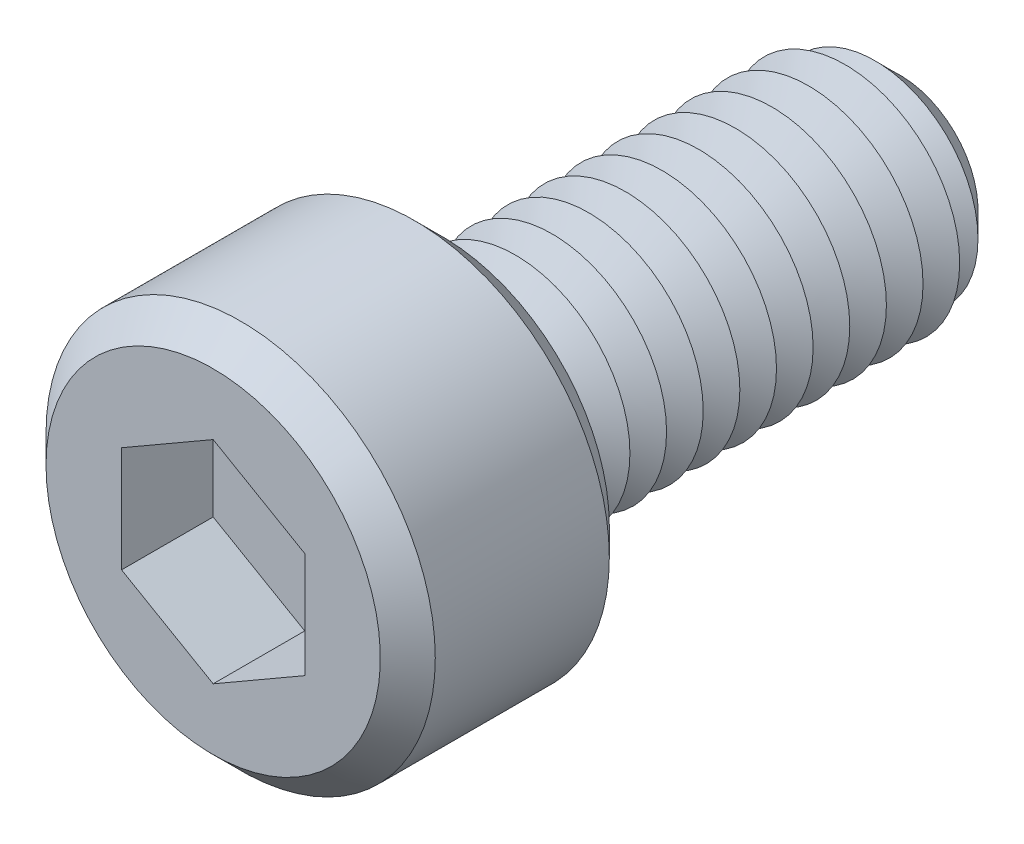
ISO-10303-21;
HEADER;
FILE_DESCRIPTION(('STEP AP214'),'2;1');
FILE_NAME('part.step','',(''),(''),'','','');
FILE_SCHEMA(('AUTOMOTIVE_DESIGN { 1 0 10303 214 1 1 1 1 }'));
ENDSEC;
DATA;
#1=APPLICATION_CONTEXT('core data for automotive mechanical design processes');
#2=APPLICATION_PROTOCOL_DEFINITION('international standard','automotive_design',2000,#1);
#3=PRODUCT_CONTEXT('',#1,'mechanical');
#4=PRODUCT('Part','Part','',(#3));
#5=PRODUCT_RELATED_PRODUCT_CATEGORY('part','',(#4));
#6=PRODUCT_DEFINITION_FORMATION('','',#4);
#7=PRODUCT_DEFINITION_CONTEXT('part definition',#1,'design');
#8=PRODUCT_DEFINITION('design','',#6,#7);
#9=PRODUCT_DEFINITION_SHAPE('','',#8);
#10=(LENGTH_UNIT() NAMED_UNIT(*) SI_UNIT(.MILLI.,.METRE.));
#11=(NAMED_UNIT(*) PLANE_ANGLE_UNIT() SI_UNIT($,.RADIAN.));
#12=(NAMED_UNIT(*) SI_UNIT($,.STERADIAN.) SOLID_ANGLE_UNIT());
#13=UNCERTAINTY_MEASURE_WITH_UNIT(LENGTH_MEASURE(1.E-05),#10,'distance_accuracy_value','');
#14=(GEOMETRIC_REPRESENTATION_CONTEXT(3) GLOBAL_UNCERTAINTY_ASSIGNED_CONTEXT((#13)) GLOBAL_UNIT_ASSIGNED_CONTEXT((#10,
#11,#12)) REPRESENTATION_CONTEXT('',''));
#15=CARTESIAN_POINT('',(0.,0.,0.));
#16=DIRECTION('',(0.,0.,1.));
#17=DIRECTION('',(1.,0.,0.));
#18=AXIS2_PLACEMENT_3D('',#15,#16,#17);
#19=CARTESIAN_POINT('',(0.,0.,5.));
#20=DIRECTION('',(0.,0.,-1.));
#21=DIRECTION('',(-1.,0.,0.));
#22=AXIS2_PLACEMENT_3D('',#19,#20,#21);
#23=CYLINDRICAL_SURFACE('',#22,4.25);
#24=CARTESIAN_POINT('',(0.,0.,0.600000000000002));
#25=DIRECTION('',(0.,0.,1.));
#26=DIRECTION('',(1.,0.,0.));
#27=AXIS2_PLACEMENT_3D('',#24,#25,#26);
#28=CIRCLE('',#27,4.25);
#29=CARTESIAN_POINT('',(4.25,0.,0.600000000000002));
#30=VERTEX_POINT('',#29);
#31=EDGE_CURVE('E272',#30,#30,#28,.T.);
#32=ORIENTED_EDGE('',*,*,#31,.T.);
#33=EDGE_LOOP('',(#32));
#34=FACE_BOUND('',#33,.T.);
#35=CARTESIAN_POINT('',(0.,0.,4.39999999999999));
#36=DIRECTION('',(0.,0.,1.));
#37=DIRECTION('',(1.,0.,0.));
#38=AXIS2_PLACEMENT_3D('',#35,#36,#37);
#39=CIRCLE('',#38,4.25);
#40=CARTESIAN_POINT('',(-4.25,0.,4.39999999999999));
#41=VERTEX_POINT('',#40);
#42=EDGE_CURVE('E266',#41,#41,#39,.F.);
#43=ORIENTED_EDGE('',*,*,#42,.T.);
#44=EDGE_LOOP('',(#43));
#45=FACE_BOUND('',#44,.T.);
#46=ADVANCED_FACE('F39',(#34,#45),#23,.T.);
#47=CARTESIAN_POINT('',(0.,0.,5.));
#48=DIRECTION('',(0.,0.,1.));
#49=DIRECTION('',(1.,0.,0.));
#50=AXIS2_PLACEMENT_3D('',#47,#48,#49);
#51=PLANE('',#50);
#52=CARTESIAN_POINT('',(0.,0.,5.));
#53=DIRECTION('',(0.,0.,1.));
#54=DIRECTION('',(1.,0.,0.));
#55=AXIS2_PLACEMENT_3D('',#52,#53,#54);
#56=CIRCLE('',#55,3.65);
#57=CARTESIAN_POINT('',(-3.65,0.,5.));
#58=VERTEX_POINT('',#57);
#59=EDGE_CURVE('E11',#58,#58,#56,.T.);
#60=ORIENTED_EDGE('',*,*,#59,.T.);
#61=EDGE_LOOP('',(#60));
#62=FACE_BOUND('',#61,.T.);
#63=DIRECTION('',(-0.866025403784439,0.5,0.));
#64=VECTOR('',#63,1.);
#65=CARTESIAN_POINT('',(2.,1.15470053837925,5.));
#66=LINE('',#65,#64);
#67=CARTESIAN_POINT('',(2.,1.15470053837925,5.));
#68=VERTEX_POINT('',#67);
#69=CARTESIAN_POINT('',(0.,2.3094010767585,5.));
#70=VERTEX_POINT('',#69);
#71=EDGE_CURVE('E55',#68,#70,#66,.T.);
#72=ORIENTED_EDGE('',*,*,#71,.F.);
#73=DIRECTION('',(0.,1.,0.));
#74=VECTOR('',#73,1.);
#75=CARTESIAN_POINT('',(2.,-1.15470053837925,5.));
#76=LINE('',#75,#74);
#77=CARTESIAN_POINT('',(2.,-1.15470053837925,5.));
#78=VERTEX_POINT('',#77);
#79=EDGE_CURVE('E151',#78,#68,#76,.T.);
#80=ORIENTED_EDGE('',*,*,#79,.F.);
#81=DIRECTION('',(0.866025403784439,0.5,0.));
#82=VECTOR('',#81,1.);
#83=CARTESIAN_POINT('',(0.,-2.3094010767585,5.));
#84=LINE('',#83,#82);
#85=CARTESIAN_POINT('',(0.,-2.3094010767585,5.));
#86=VERTEX_POINT('',#85);
#87=EDGE_CURVE('E148',#86,#78,#84,.T.);
#88=ORIENTED_EDGE('',*,*,#87,.F.);
#89=DIRECTION('',(0.866025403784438,-0.5,0.));
#90=VECTOR('',#89,1.);
#91=CARTESIAN_POINT('',(-2.,-1.15470053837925,5.));
#92=LINE('',#91,#90);
#93=CARTESIAN_POINT('',(-2.,-1.15470053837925,5.));
#94=VERTEX_POINT('',#93);
#95=EDGE_CURVE('E103',#94,#86,#92,.T.);
#96=ORIENTED_EDGE('',*,*,#95,.F.);
#97=DIRECTION('',(0.,-1.,0.));
#98=VECTOR('',#97,1.);
#99=CARTESIAN_POINT('',(-2.,1.15470053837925,5.));
#100=LINE('',#99,#98);
#101=CARTESIAN_POINT('',(-2.,1.15470053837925,5.));
#102=VERTEX_POINT('',#101);
#103=EDGE_CURVE('E142',#102,#94,#100,.T.);
#104=ORIENTED_EDGE('',*,*,#103,.F.);
#105=DIRECTION('',(-0.866025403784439,-0.5,0.));
#106=VECTOR('',#105,1.);
#107=CARTESIAN_POINT('',(0.,2.3094010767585,5.));
#108=LINE('',#107,#106);
#109=EDGE_CURVE('E137',#70,#102,#108,.T.);
#110=ORIENTED_EDGE('',*,*,#109,.F.);
#111=EDGE_LOOP('',(#72,#80,#88,#96,#104,#110));
#112=FACE_BOUND('',#111,.T.);
#113=ADVANCED_FACE('F291',(#62,#112),#51,.T.);
#114=CARTESIAN_POINT('',(0.,0.,0.));
#115=DIRECTION('',(0.,0.,1.));
#116=DIRECTION('',(1.,0.,0.));
#117=AXIS2_PLACEMENT_3D('',#114,#115,#116);
#118=PLANE('',#117);
#119=CARTESIAN_POINT('',(0.,0.,0.));
#120=DIRECTION('',(0.,0.,1.));
#121=DIRECTION('',(1.,0.,0.));
#122=AXIS2_PLACEMENT_3D('',#119,#120,#121);
#123=CIRCLE('',#122,3.65);
#124=CARTESIAN_POINT('',(3.65,0.,0.));
#125=VERTEX_POINT('',#124);
#126=EDGE_CURVE('E48',#125,#125,#123,.F.);
#127=ORIENTED_EDGE('',*,*,#126,.T.);
#128=EDGE_LOOP('',(#127));
#129=FACE_BOUND('',#128,.T.);
#130=CARTESIAN_POINT('',(0.,0.,0.));
#131=DIRECTION('',(0.,0.,1.));
#132=DIRECTION('',(1.,0.,0.));
#133=AXIS2_PLACEMENT_3D('',#130,#131,#132);
#134=CIRCLE('',#133,2.5);
#135=CARTESIAN_POINT('',(2.5,0.,0.));
#136=VERTEX_POINT('',#135);
#137=EDGE_CURVE('E258',#136,#136,#134,.T.);
#138=ORIENTED_EDGE('',*,*,#137,.T.);
#139=EDGE_LOOP('',(#138));
#140=FACE_BOUND('',#139,.T.);
#141=ADVANCED_FACE('F280',(#129,#140),#118,.F.);
#142=CARTESIAN_POINT('',(0.,0.,0.));
#143=DIRECTION('',(0.,0.,1.));
#144=DIRECTION('',(1.,0.,0.));
#145=AXIS2_PLACEMENT_3D('',#142,#143,#144);
#146=CONICAL_SURFACE('',#145,2.5,1.0471975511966);
#147=CARTESIAN_POINT('',(0.,0.,-0.4));
#148=DIRECTION('',(0.,0.,1.));
#149=DIRECTION('',(1.,0.,0.));
#150=AXIS2_PLACEMENT_3D('',#147,#148,#149);
#151=CIRCLE('',#150,1.80717967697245);
#152=CARTESIAN_POINT('',(1.80717967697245,0.,-0.4));
#153=VERTEX_POINT('',#152);
#154=EDGE_CURVE('E254',#153,#153,#151,.T.);
#155=ORIENTED_EDGE('',*,*,#154,.T.);
#156=EDGE_LOOP('',(#155));
#157=FACE_BOUND('',#156,.T.);
#158=ORIENTED_EDGE('',*,*,#137,.F.);
#159=EDGE_LOOP('',(#158));
#160=FACE_BOUND('',#159,.T.);
#161=ADVANCED_FACE('F436',(#157,#160),#146,.T.);
#162=CARTESIAN_POINT('',(0.,0.,-0.4));
#163=DIRECTION('',(0.,0.,-1.));
#164=DIRECTION('',(-1.,0.,0.));
#165=AXIS2_PLACEMENT_3D('',#162,#163,#164);
#166=CONICAL_SURFACE('',#165,1.80717967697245,1.0471975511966);
#167=CARTESIAN_POINT('',(0.,0.,-0.8));
#168=DIRECTION('',(0.,0.,1.));
#169=DIRECTION('',(1.,0.,0.));
#170=AXIS2_PLACEMENT_3D('',#167,#168,#169);
#171=CIRCLE('',#170,2.5);
#172=CARTESIAN_POINT('',(2.5,0.,-0.8));
#173=VERTEX_POINT('',#172);
#174=EDGE_CURVE('E250',#173,#173,#171,.T.);
#175=ORIENTED_EDGE('',*,*,#174,.T.);
#176=EDGE_LOOP('',(#175));
#177=FACE_BOUND('',#176,.T.);
#178=ORIENTED_EDGE('',*,*,#154,.F.);
#179=EDGE_LOOP('',(#178));
#180=FACE_BOUND('',#179,.T.);
#181=ADVANCED_FACE('F432',(#177,#180),#166,.T.);
#182=CARTESIAN_POINT('',(0.,0.,-0.8));
#183=DIRECTION('',(0.,0.,1.));
#184=DIRECTION('',(1.,0.,0.));
#185=AXIS2_PLACEMENT_3D('',#182,#183,#184);
#186=CONICAL_SURFACE('',#185,2.5,1.0471975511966);
#187=CARTESIAN_POINT('',(0.,0.,-1.2));
#188=DIRECTION('',(0.,0.,1.));
#189=DIRECTION('',(1.,0.,0.));
#190=AXIS2_PLACEMENT_3D('',#187,#188,#189);
#191=CIRCLE('',#190,1.80717967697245);
#192=CARTESIAN_POINT('',(1.80717967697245,0.,-1.2));
#193=VERTEX_POINT('',#192);
#194=EDGE_CURVE('E246',#193,#193,#191,.T.);
#195=ORIENTED_EDGE('',*,*,#194,.T.);
#196=EDGE_LOOP('',(#195));
#197=FACE_BOUND('',#196,.T.);
#198=ORIENTED_EDGE('',*,*,#174,.F.);
#199=EDGE_LOOP('',(#198));
#200=FACE_BOUND('',#199,.T.);
#201=ADVANCED_FACE('F428',(#197,#200),#186,.T.);
#202=CARTESIAN_POINT('',(0.,0.,-1.2));
#203=DIRECTION('',(0.,0.,-1.));
#204=DIRECTION('',(-1.,0.,0.));
#205=AXIS2_PLACEMENT_3D('',#202,#203,#204);
#206=CONICAL_SURFACE('',#205,1.80717967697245,1.0471975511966);
#207=CARTESIAN_POINT('',(0.,0.,-1.6));
#208=DIRECTION('',(0.,0.,1.));
#209=DIRECTION('',(1.,0.,0.));
#210=AXIS2_PLACEMENT_3D('',#207,#208,#209);
#211=CIRCLE('',#210,2.5);
#212=CARTESIAN_POINT('',(2.5,0.,-1.6));
#213=VERTEX_POINT('',#212);
#214=EDGE_CURVE('E242',#213,#213,#211,.T.);
#215=ORIENTED_EDGE('',*,*,#214,.T.);
#216=EDGE_LOOP('',(#215));
#217=FACE_BOUND('',#216,.T.);
#218=ORIENTED_EDGE('',*,*,#194,.F.);
#219=EDGE_LOOP('',(#218));
#220=FACE_BOUND('',#219,.T.);
#221=ADVANCED_FACE('F424',(#217,#220),#206,.T.);
#222=CARTESIAN_POINT('',(0.,0.,-1.6));
#223=DIRECTION('',(0.,0.,1.));
#224=DIRECTION('',(1.,0.,0.));
#225=AXIS2_PLACEMENT_3D('',#222,#223,#224);
#226=CONICAL_SURFACE('',#225,2.5,1.0471975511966);
#227=CARTESIAN_POINT('',(0.,0.,-2.));
#228=DIRECTION('',(0.,0.,1.));
#229=DIRECTION('',(1.,0.,0.));
#230=AXIS2_PLACEMENT_3D('',#227,#228,#229);
#231=CIRCLE('',#230,1.80717967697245);
#232=CARTESIAN_POINT('',(1.80717967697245,0.,-2.));
#233=VERTEX_POINT('',#232);
#234=EDGE_CURVE('E238',#233,#233,#231,.T.);
#235=ORIENTED_EDGE('',*,*,#234,.T.);
#236=EDGE_LOOP('',(#235));
#237=FACE_BOUND('',#236,.T.);
#238=ORIENTED_EDGE('',*,*,#214,.F.);
#239=EDGE_LOOP('',(#238));
#240=FACE_BOUND('',#239,.T.);
#241=ADVANCED_FACE('F420',(#237,#240),#226,.T.);
#242=CARTESIAN_POINT('',(0.,0.,-2.));
#243=DIRECTION('',(0.,0.,-1.));
#244=DIRECTION('',(-1.,0.,0.));
#245=AXIS2_PLACEMENT_3D('',#242,#243,#244);
#246=CONICAL_SURFACE('',#245,1.80717967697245,1.0471975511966);
#247=CARTESIAN_POINT('',(0.,0.,-2.4));
#248=DIRECTION('',(0.,0.,1.));
#249=DIRECTION('',(1.,0.,0.));
#250=AXIS2_PLACEMENT_3D('',#247,#248,#249);
#251=CIRCLE('',#250,2.5);
#252=CARTESIAN_POINT('',(2.5,0.,-2.4));
#253=VERTEX_POINT('',#252);
#254=EDGE_CURVE('E234',#253,#253,#251,.T.);
#255=ORIENTED_EDGE('',*,*,#254,.T.);
#256=EDGE_LOOP('',(#255));
#257=FACE_BOUND('',#256,.T.);
#258=ORIENTED_EDGE('',*,*,#234,.F.);
#259=EDGE_LOOP('',(#258));
#260=FACE_BOUND('',#259,.T.);
#261=ADVANCED_FACE('F416',(#257,#260),#246,.T.);
#262=CARTESIAN_POINT('',(0.,0.,-2.4));
#263=DIRECTION('',(0.,0.,1.));
#264=DIRECTION('',(1.,0.,0.));
#265=AXIS2_PLACEMENT_3D('',#262,#263,#264);
#266=CONICAL_SURFACE('',#265,2.5,1.0471975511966);
#267=CARTESIAN_POINT('',(0.,0.,-2.8));
#268=DIRECTION('',(0.,0.,1.));
#269=DIRECTION('',(1.,0.,0.));
#270=AXIS2_PLACEMENT_3D('',#267,#268,#269);
#271=CIRCLE('',#270,1.80717967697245);
#272=CARTESIAN_POINT('',(1.80717967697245,0.,-2.8));
#273=VERTEX_POINT('',#272);
#274=EDGE_CURVE('E230',#273,#273,#271,.T.);
#275=ORIENTED_EDGE('',*,*,#274,.T.);
#276=EDGE_LOOP('',(#275));
#277=FACE_BOUND('',#276,.T.);
#278=ORIENTED_EDGE('',*,*,#254,.F.);
#279=EDGE_LOOP('',(#278));
#280=FACE_BOUND('',#279,.T.);
#281=ADVANCED_FACE('F412',(#277,#280),#266,.T.);
#282=CARTESIAN_POINT('',(0.,0.,-2.8));
#283=DIRECTION('',(0.,0.,-1.));
#284=DIRECTION('',(-1.,0.,0.));
#285=AXIS2_PLACEMENT_3D('',#282,#283,#284);
#286=CONICAL_SURFACE('',#285,1.80717967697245,1.0471975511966);
#287=CARTESIAN_POINT('',(0.,0.,-3.2));
#288=DIRECTION('',(0.,0.,1.));
#289=DIRECTION('',(1.,0.,0.));
#290=AXIS2_PLACEMENT_3D('',#287,#288,#289);
#291=CIRCLE('',#290,2.5);
#292=CARTESIAN_POINT('',(2.5,0.,-3.2));
#293=VERTEX_POINT('',#292);
#294=EDGE_CURVE('E226',#293,#293,#291,.T.);
#295=ORIENTED_EDGE('',*,*,#294,.T.);
#296=EDGE_LOOP('',(#295));
#297=FACE_BOUND('',#296,.T.);
#298=ORIENTED_EDGE('',*,*,#274,.F.);
#299=EDGE_LOOP('',(#298));
#300=FACE_BOUND('',#299,.T.);
#301=ADVANCED_FACE('F408',(#297,#300),#286,.T.);
#302=CARTESIAN_POINT('',(0.,0.,-3.2));
#303=DIRECTION('',(0.,0.,1.));
#304=DIRECTION('',(1.,0.,0.));
#305=AXIS2_PLACEMENT_3D('',#302,#303,#304);
#306=CONICAL_SURFACE('',#305,2.5,1.0471975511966);
#307=CARTESIAN_POINT('',(0.,0.,-3.6));
#308=DIRECTION('',(0.,0.,1.));
#309=DIRECTION('',(1.,0.,0.));
#310=AXIS2_PLACEMENT_3D('',#307,#308,#309);
#311=CIRCLE('',#310,1.80717967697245);
#312=CARTESIAN_POINT('',(1.80717967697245,0.,-3.6));
#313=VERTEX_POINT('',#312);
#314=EDGE_CURVE('E222',#313,#313,#311,.T.);
#315=ORIENTED_EDGE('',*,*,#314,.T.);
#316=EDGE_LOOP('',(#315));
#317=FACE_BOUND('',#316,.T.);
#318=ORIENTED_EDGE('',*,*,#294,.F.);
#319=EDGE_LOOP('',(#318));
#320=FACE_BOUND('',#319,.T.);
#321=ADVANCED_FACE('F404',(#317,#320),#306,.T.);
#322=CARTESIAN_POINT('',(0.,0.,-3.6));
#323=DIRECTION('',(0.,0.,-1.));
#324=DIRECTION('',(-1.,0.,0.));
#325=AXIS2_PLACEMENT_3D('',#322,#323,#324);
#326=CONICAL_SURFACE('',#325,1.80717967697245,1.0471975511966);
#327=CARTESIAN_POINT('',(0.,0.,-4.));
#328=DIRECTION('',(0.,0.,1.));
#329=DIRECTION('',(1.,0.,0.));
#330=AXIS2_PLACEMENT_3D('',#327,#328,#329);
#331=CIRCLE('',#330,2.5);
#332=CARTESIAN_POINT('',(2.5,0.,-4.));
#333=VERTEX_POINT('',#332);
#334=EDGE_CURVE('E218',#333,#333,#331,.T.);
#335=ORIENTED_EDGE('',*,*,#334,.T.);
#336=EDGE_LOOP('',(#335));
#337=FACE_BOUND('',#336,.T.);
#338=ORIENTED_EDGE('',*,*,#314,.F.);
#339=EDGE_LOOP('',(#338));
#340=FACE_BOUND('',#339,.T.);
#341=ADVANCED_FACE('F400',(#337,#340),#326,.T.);
#342=CARTESIAN_POINT('',(0.,0.,-4.));
#343=DIRECTION('',(0.,0.,1.));
#344=DIRECTION('',(1.,0.,0.));
#345=AXIS2_PLACEMENT_3D('',#342,#343,#344);
#346=CONICAL_SURFACE('',#345,2.5,1.0471975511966);
#347=CARTESIAN_POINT('',(0.,0.,-4.4));
#348=DIRECTION('',(0.,0.,1.));
#349=DIRECTION('',(1.,0.,0.));
#350=AXIS2_PLACEMENT_3D('',#347,#348,#349);
#351=CIRCLE('',#350,1.80717967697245);
#352=CARTESIAN_POINT('',(1.80717967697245,0.,-4.4));
#353=VERTEX_POINT('',#352);
#354=EDGE_CURVE('E214',#353,#353,#351,.T.);
#355=ORIENTED_EDGE('',*,*,#354,.T.);
#356=EDGE_LOOP('',(#355));
#357=FACE_BOUND('',#356,.T.);
#358=ORIENTED_EDGE('',*,*,#334,.F.);
#359=EDGE_LOOP('',(#358));
#360=FACE_BOUND('',#359,.T.);
#361=ADVANCED_FACE('F396',(#357,#360),#346,.T.);
#362=CARTESIAN_POINT('',(0.,0.,-4.4));
#363=DIRECTION('',(0.,0.,-1.));
#364=DIRECTION('',(-1.,0.,0.));
#365=AXIS2_PLACEMENT_3D('',#362,#363,#364);
#366=CONICAL_SURFACE('',#365,1.80717967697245,1.0471975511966);
#367=CARTESIAN_POINT('',(0.,0.,-4.8));
#368=DIRECTION('',(0.,0.,1.));
#369=DIRECTION('',(1.,0.,0.));
#370=AXIS2_PLACEMENT_3D('',#367,#368,#369);
#371=CIRCLE('',#370,2.5);
#372=CARTESIAN_POINT('',(2.5,0.,-4.8));
#373=VERTEX_POINT('',#372);
#374=EDGE_CURVE('E210',#373,#373,#371,.T.);
#375=ORIENTED_EDGE('',*,*,#374,.T.);
#376=EDGE_LOOP('',(#375));
#377=FACE_BOUND('',#376,.T.);
#378=ORIENTED_EDGE('',*,*,#354,.F.);
#379=EDGE_LOOP('',(#378));
#380=FACE_BOUND('',#379,.T.);
#381=ADVANCED_FACE('F392',(#377,#380),#366,.T.);
#382=CARTESIAN_POINT('',(0.,0.,-4.8));
#383=DIRECTION('',(0.,0.,1.));
#384=DIRECTION('',(1.,0.,0.));
#385=AXIS2_PLACEMENT_3D('',#382,#383,#384);
#386=CONICAL_SURFACE('',#385,2.5,1.0471975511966);
#387=CARTESIAN_POINT('',(0.,0.,-5.2));
#388=DIRECTION('',(0.,0.,1.));
#389=DIRECTION('',(1.,0.,0.));
#390=AXIS2_PLACEMENT_3D('',#387,#388,#389);
#391=CIRCLE('',#390,1.80717967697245);
#392=CARTESIAN_POINT('',(1.80717967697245,0.,-5.2));
#393=VERTEX_POINT('',#392);
#394=EDGE_CURVE('E206',#393,#393,#391,.T.);
#395=ORIENTED_EDGE('',*,*,#394,.T.);
#396=EDGE_LOOP('',(#395));
#397=FACE_BOUND('',#396,.T.);
#398=ORIENTED_EDGE('',*,*,#374,.F.);
#399=EDGE_LOOP('',(#398));
#400=FACE_BOUND('',#399,.T.);
#401=ADVANCED_FACE('F388',(#397,#400),#386,.T.);
#402=CARTESIAN_POINT('',(0.,0.,-5.2));
#403=DIRECTION('',(0.,0.,-1.));
#404=DIRECTION('',(-1.,0.,0.));
#405=AXIS2_PLACEMENT_3D('',#402,#403,#404);
#406=CONICAL_SURFACE('',#405,1.80717967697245,1.0471975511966);
#407=CARTESIAN_POINT('',(0.,0.,-5.6));
#408=DIRECTION('',(0.,0.,1.));
#409=DIRECTION('',(1.,0.,0.));
#410=AXIS2_PLACEMENT_3D('',#407,#408,#409);
#411=CIRCLE('',#410,2.5);
#412=CARTESIAN_POINT('',(2.5,0.,-5.6));
#413=VERTEX_POINT('',#412);
#414=EDGE_CURVE('E202',#413,#413,#411,.T.);
#415=ORIENTED_EDGE('',*,*,#414,.T.);
#416=EDGE_LOOP('',(#415));
#417=FACE_BOUND('',#416,.T.);
#418=ORIENTED_EDGE('',*,*,#394,.F.);
#419=EDGE_LOOP('',(#418));
#420=FACE_BOUND('',#419,.T.);
#421=ADVANCED_FACE('F384',(#417,#420),#406,.T.);
#422=CARTESIAN_POINT('',(0.,0.,-5.6));
#423=DIRECTION('',(0.,0.,1.));
#424=DIRECTION('',(1.,0.,0.));
#425=AXIS2_PLACEMENT_3D('',#422,#423,#424);
#426=CONICAL_SURFACE('',#425,2.5,1.0471975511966);
#427=CARTESIAN_POINT('',(0.,0.,-6.));
#428=DIRECTION('',(0.,0.,1.));
#429=DIRECTION('',(1.,0.,0.));
#430=AXIS2_PLACEMENT_3D('',#427,#428,#429);
#431=CIRCLE('',#430,1.80717967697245);
#432=CARTESIAN_POINT('',(1.80717967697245,0.,-6.));
#433=VERTEX_POINT('',#432);
#434=EDGE_CURVE('E198',#433,#433,#431,.T.);
#435=ORIENTED_EDGE('',*,*,#434,.T.);
#436=EDGE_LOOP('',(#435));
#437=FACE_BOUND('',#436,.T.);
#438=ORIENTED_EDGE('',*,*,#414,.F.);
#439=EDGE_LOOP('',(#438));
#440=FACE_BOUND('',#439,.T.);
#441=ADVANCED_FACE('F380',(#437,#440),#426,.T.);
#442=CARTESIAN_POINT('',(0.,0.,-6.));
#443=DIRECTION('',(0.,0.,-1.));
#444=DIRECTION('',(-1.,0.,0.));
#445=AXIS2_PLACEMENT_3D('',#442,#443,#444);
#446=CONICAL_SURFACE('',#445,1.80717967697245,1.0471975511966);
#447=CARTESIAN_POINT('',(0.,0.,-6.4));
#448=DIRECTION('',(0.,0.,1.));
#449=DIRECTION('',(1.,0.,0.));
#450=AXIS2_PLACEMENT_3D('',#447,#448,#449);
#451=CIRCLE('',#450,2.5);
#452=CARTESIAN_POINT('',(2.5,0.,-6.4));
#453=VERTEX_POINT('',#452);
#454=EDGE_CURVE('E194',#453,#453,#451,.T.);
#455=ORIENTED_EDGE('',*,*,#454,.T.);
#456=EDGE_LOOP('',(#455));
#457=FACE_BOUND('',#456,.T.);
#458=ORIENTED_EDGE('',*,*,#434,.F.);
#459=EDGE_LOOP('',(#458));
#460=FACE_BOUND('',#459,.T.);
#461=ADVANCED_FACE('F376',(#457,#460),#446,.T.);
#462=CARTESIAN_POINT('',(0.,0.,-6.4));
#463=DIRECTION('',(0.,0.,1.));
#464=DIRECTION('',(1.,0.,0.));
#465=AXIS2_PLACEMENT_3D('',#462,#463,#464);
#466=CONICAL_SURFACE('',#465,2.5,1.0471975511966);
#467=CARTESIAN_POINT('',(0.,0.,-6.8));
#468=DIRECTION('',(0.,0.,1.));
#469=DIRECTION('',(1.,0.,0.));
#470=AXIS2_PLACEMENT_3D('',#467,#468,#469);
#471=CIRCLE('',#470,1.80717967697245);
#472=CARTESIAN_POINT('',(1.80717967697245,0.,-6.8));
#473=VERTEX_POINT('',#472);
#474=EDGE_CURVE('E191',#473,#473,#471,.T.);
#475=ORIENTED_EDGE('',*,*,#474,.T.);
#476=EDGE_LOOP('',(#475));
#477=FACE_BOUND('',#476,.T.);
#478=ORIENTED_EDGE('',*,*,#454,.F.);
#479=EDGE_LOOP('',(#478));
#480=FACE_BOUND('',#479,.T.);
#481=ADVANCED_FACE('F372',(#477,#480),#466,.T.);
#482=CARTESIAN_POINT('',(0.,0.,-6.8));
#483=DIRECTION('',(0.,0.,-1.));
#484=DIRECTION('',(-1.,0.,0.));
#485=AXIS2_PLACEMENT_3D('',#482,#483,#484);
#486=CONICAL_SURFACE('',#485,1.80717967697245,1.0471975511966);
#487=CARTESIAN_POINT('',(0.,0.,-7.2));
#488=DIRECTION('',(0.,0.,1.));
#489=DIRECTION('',(1.,0.,0.));
#490=AXIS2_PLACEMENT_3D('',#487,#488,#489);
#491=CIRCLE('',#490,2.5);
#492=CARTESIAN_POINT('',(2.5,0.,-7.2));
#493=VERTEX_POINT('',#492);
#494=EDGE_CURVE('E187',#493,#493,#491,.T.);
#495=ORIENTED_EDGE('',*,*,#494,.T.);
#496=EDGE_LOOP('',(#495));
#497=FACE_BOUND('',#496,.T.);
#498=ORIENTED_EDGE('',*,*,#474,.F.);
#499=EDGE_LOOP('',(#498));
#500=FACE_BOUND('',#499,.T.);
#501=ADVANCED_FACE('F368',(#497,#500),#486,.T.);
#502=CARTESIAN_POINT('',(0.,0.,-7.2));
#503=DIRECTION('',(0.,0.,1.));
#504=DIRECTION('',(1.,0.,0.));
#505=AXIS2_PLACEMENT_3D('',#502,#503,#504);
#506=CONICAL_SURFACE('',#505,2.5,1.0471975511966);
#507=CARTESIAN_POINT('',(0.,0.,-7.6));
#508=DIRECTION('',(0.,0.,1.));
#509=DIRECTION('',(1.,0.,0.));
#510=AXIS2_PLACEMENT_3D('',#507,#508,#509);
#511=CIRCLE('',#510,1.80717967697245);
#512=CARTESIAN_POINT('',(1.80717967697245,0.,-7.6));
#513=VERTEX_POINT('',#512);
#514=EDGE_CURVE('E183',#513,#513,#511,.T.);
#515=ORIENTED_EDGE('',*,*,#514,.T.);
#516=EDGE_LOOP('',(#515));
#517=FACE_BOUND('',#516,.T.);
#518=ORIENTED_EDGE('',*,*,#494,.F.);
#519=EDGE_LOOP('',(#518));
#520=FACE_BOUND('',#519,.T.);
#521=ADVANCED_FACE('F364',(#517,#520),#506,.T.);
#522=CARTESIAN_POINT('',(0.,0.,-7.6));
#523=DIRECTION('',(0.,0.,-1.));
#524=DIRECTION('',(-1.,0.,0.));
#525=AXIS2_PLACEMENT_3D('',#522,#523,#524);
#526=CONICAL_SURFACE('',#525,1.80717967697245,1.0471975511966);
#527=CARTESIAN_POINT('',(0.,0.,-8.));
#528=DIRECTION('',(0.,0.,1.));
#529=DIRECTION('',(1.,0.,0.));
#530=AXIS2_PLACEMENT_3D('',#527,#528,#529);
#531=CIRCLE('',#530,2.5);
#532=CARTESIAN_POINT('',(2.5,0.,-8.));
#533=VERTEX_POINT('',#532);
#534=EDGE_CURVE('E179',#533,#533,#531,.T.);
#535=ORIENTED_EDGE('',*,*,#534,.T.);
#536=EDGE_LOOP('',(#535));
#537=FACE_BOUND('',#536,.T.);
#538=ORIENTED_EDGE('',*,*,#514,.F.);
#539=EDGE_LOOP('',(#538));
#540=FACE_BOUND('',#539,.T.);
#541=ADVANCED_FACE('F360',(#537,#540),#526,.T.);
#542=CARTESIAN_POINT('',(0.,0.,-8.));
#543=DIRECTION('',(0.,0.,1.));
#544=DIRECTION('',(1.,0.,0.));
#545=AXIS2_PLACEMENT_3D('',#542,#543,#544);
#546=CONICAL_SURFACE('',#545,2.5,1.0471975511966);
#547=CARTESIAN_POINT('',(0.,0.,-8.4));
#548=DIRECTION('',(0.,0.,1.));
#549=DIRECTION('',(1.,0.,0.));
#550=AXIS2_PLACEMENT_3D('',#547,#548,#549);
#551=CIRCLE('',#550,1.80717967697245);
#552=CARTESIAN_POINT('',(1.80717967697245,0.,-8.4));
#553=VERTEX_POINT('',#552);
#554=EDGE_CURVE('E175',#553,#553,#551,.T.);
#555=ORIENTED_EDGE('',*,*,#554,.T.);
#556=EDGE_LOOP('',(#555));
#557=FACE_BOUND('',#556,.T.);
#558=ORIENTED_EDGE('',*,*,#534,.F.);
#559=EDGE_LOOP('',(#558));
#560=FACE_BOUND('',#559,.T.);
#561=ADVANCED_FACE('F356',(#557,#560),#546,.T.);
#562=CARTESIAN_POINT('',(0.,0.,-8.4));
#563=DIRECTION('',(0.,0.,-1.));
#564=DIRECTION('',(-1.,0.,0.));
#565=AXIS2_PLACEMENT_3D('',#562,#563,#564);
#566=CONICAL_SURFACE('',#565,1.80717967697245,1.0471975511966);
#567=CARTESIAN_POINT('',(0.,0.,-8.8));
#568=DIRECTION('',(0.,0.,1.));
#569=DIRECTION('',(1.,0.,0.));
#570=AXIS2_PLACEMENT_3D('',#567,#568,#569);
#571=CIRCLE('',#570,2.5);
#572=CARTESIAN_POINT('',(2.5,0.,-8.8));
#573=VERTEX_POINT('',#572);
#574=EDGE_CURVE('E170',#573,#573,#571,.T.);
#575=ORIENTED_EDGE('',*,*,#574,.T.);
#576=EDGE_LOOP('',(#575));
#577=FACE_BOUND('',#576,.T.);
#578=ORIENTED_EDGE('',*,*,#554,.F.);
#579=EDGE_LOOP('',(#578));
#580=FACE_BOUND('',#579,.T.);
#581=ADVANCED_FACE('F352',(#577,#580),#566,.T.);
#582=CARTESIAN_POINT('',(0.,0.,-8.8));
#583=DIRECTION('',(0.,0.,1.));
#584=DIRECTION('',(1.,0.,0.));
#585=AXIS2_PLACEMENT_3D('',#582,#583,#584);
#586=CONICAL_SURFACE('',#585,2.5,1.0471975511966);
#587=CARTESIAN_POINT('',(0.,0.,-9.2));
#588=DIRECTION('',(0.,0.,1.));
#589=DIRECTION('',(1.,0.,0.));
#590=AXIS2_PLACEMENT_3D('',#587,#588,#589);
#591=CIRCLE('',#590,1.80717967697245);
#592=CARTESIAN_POINT('',(1.80717967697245,0.,-9.2));
#593=VERTEX_POINT('',#592);
#594=EDGE_CURVE('E157',#593,#593,#591,.T.);
#595=ORIENTED_EDGE('',*,*,#594,.T.);
#596=EDGE_LOOP('',(#595));
#597=FACE_BOUND('',#596,.T.);
#598=ORIENTED_EDGE('',*,*,#574,.F.);
#599=EDGE_LOOP('',(#598));
#600=FACE_BOUND('',#599,.T.);
#601=ADVANCED_FACE('F348',(#597,#600),#586,.T.);
#602=CARTESIAN_POINT('',(0.,0.,-9.2));
#603=DIRECTION('',(0.,0.,-1.));
#604=DIRECTION('',(-1.,0.,0.));
#605=AXIS2_PLACEMENT_3D('',#602,#603,#604);
#606=CONICAL_SURFACE('',#605,1.80717967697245,1.0471975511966);
#607=CARTESIAN_POINT('',(0.,0.,-9.45358983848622));
#608=DIRECTION('',(0.,0.,-1.));
#609=DIRECTION('',(-1.,0.,0.));
#610=AXIS2_PLACEMENT_3D('',#607,#608,#609);
#611=CIRCLE('',#610,2.24641016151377);
#612=CARTESIAN_POINT('',(-2.24641016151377,0.,-9.45358983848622));
#613=VERTEX_POINT('',#612);
#614=EDGE_CURVE('E174',#613,#613,#611,.T.);
#615=ORIENTED_EDGE('',*,*,#614,.F.);
#616=EDGE_LOOP('',(#615));
#617=FACE_BOUND('',#616,.T.);
#618=ORIENTED_EDGE('',*,*,#594,.F.);
#619=EDGE_LOOP('',(#618));
#620=FACE_BOUND('',#619,.T.);
#621=ADVANCED_FACE('F344',(#617,#620),#606,.T.);
#622=CARTESIAN_POINT('',(0.,0.,-10.));
#623=DIRECTION('',(0.,0.,-1.));
#624=DIRECTION('',(-1.,0.,0.));
#625=AXIS2_PLACEMENT_3D('',#622,#623,#624);
#626=PLANE('',#625);
#627=CARTESIAN_POINT('',(0.,0.,-10.));
#628=DIRECTION('',(0.,0.,-1.));
#629=DIRECTION('',(-1.,0.,0.));
#630=AXIS2_PLACEMENT_3D('',#627,#628,#629);
#631=CIRCLE('',#630,0.65);
#632=CARTESIAN_POINT('',(-0.65,0.,-10.));
#633=VERTEX_POINT('',#632);
#634=EDGE_CURVE('E138',#633,#633,#631,.F.);
#635=ORIENTED_EDGE('',*,*,#634,.T.);
#636=EDGE_LOOP('',(#635));
#637=FACE_BOUND('',#636,.T.);
#638=CARTESIAN_POINT('',(0.,0.,-10.));
#639=DIRECTION('',(0.,0.,-1.));
#640=DIRECTION('',(-1.,0.,0.));
#641=AXIS2_PLACEMENT_3D('',#638,#639,#640);
#642=CIRCLE('',#641,1.7);
#643=CARTESIAN_POINT('',(-1.7,0.,-10.));
#644=VERTEX_POINT('',#643);
#645=EDGE_CURVE('E262',#644,#644,#642,.T.);
#646=ORIENTED_EDGE('',*,*,#645,.T.);
#647=EDGE_LOOP('',(#646));
#648=FACE_BOUND('',#647,.T.);
#649=ADVANCED_FACE('F347',(#637,#648),#626,.T.);
#650=CARTESIAN_POINT('',(0.,0.,-10.));
#651=DIRECTION('',(0.,0.,1.));
#652=DIRECTION('',(1.,0.,0.));
#653=AXIS2_PLACEMENT_3D('',#650,#651,#652);
#654=CONICAL_SURFACE('',#653,1.7,0.785398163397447);
#655=ORIENTED_EDGE('',*,*,#645,.F.);
#656=EDGE_LOOP('',(#655));
#657=FACE_BOUND('',#656,.T.);
#658=ORIENTED_EDGE('',*,*,#614,.T.);
#659=EDGE_LOOP('',(#658));
#660=FACE_BOUND('',#659,.T.);
#661=ADVANCED_FACE('F343',(#657,#660),#654,.T.);
#662=CARTESIAN_POINT('',(2.,1.15470053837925,3.));
#663=DIRECTION('',(0.5,0.866025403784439,0.));
#664=DIRECTION('',(-0.866025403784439,0.5,0.));
#665=AXIS2_PLACEMENT_3D('',#662,#663,#664);
#666=PLANE('',#665);
#667=ORIENTED_EDGE('',*,*,#71,.T.);
#668=DIRECTION('',(0.,0.,1.));
#669=VECTOR('',#668,1.);
#670=CARTESIAN_POINT('',(0.,2.3094010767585,3.));
#671=LINE('',#670,#669);
#672=CARTESIAN_POINT('',(0.,2.3094010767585,3.));
#673=VERTEX_POINT('',#672);
#674=EDGE_CURVE('E85',#673,#70,#671,.T.);
#675=ORIENTED_EDGE('',*,*,#674,.F.);
#676=DIRECTION('',(-0.866025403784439,0.5,0.));
#677=VECTOR('',#676,1.);
#678=CARTESIAN_POINT('',(2.,1.15470053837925,3.));
#679=LINE('',#678,#677);
#680=CARTESIAN_POINT('',(2.,1.15470053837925,3.));
#681=VERTEX_POINT('',#680);
#682=EDGE_CURVE('E154',#681,#673,#679,.T.);
#683=ORIENTED_EDGE('',*,*,#682,.F.);
#684=DIRECTION('',(0.,0.,1.));
#685=VECTOR('',#684,1.);
#686=CARTESIAN_POINT('',(2.,1.15470053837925,3.));
#687=LINE('',#686,#685);
#688=EDGE_CURVE('E63',#681,#68,#687,.T.);
#689=ORIENTED_EDGE('',*,*,#688,.T.);
#690=EDGE_LOOP('',(#667,#675,#683,#689));
#691=FACE_BOUND('',#690,.T.);
#692=ADVANCED_FACE('F333',(#691),#666,.F.);
#693=CARTESIAN_POINT('',(2.,-1.15470053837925,3.));
#694=DIRECTION('',(1.,0.,0.));
#695=DIRECTION('',(0.,0.,-1.));
#696=AXIS2_PLACEMENT_3D('',#693,#694,#695);
#697=PLANE('',#696);
#698=ORIENTED_EDGE('',*,*,#79,.T.);
#699=ORIENTED_EDGE('',*,*,#688,.F.);
#700=DIRECTION('',(0.,1.,0.));
#701=VECTOR('',#700,1.);
#702=CARTESIAN_POINT('',(2.,-1.15470053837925,3.));
#703=LINE('',#702,#701);
#704=CARTESIAN_POINT('',(2.,-1.15470053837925,3.));
#705=VERTEX_POINT('',#704);
#706=EDGE_CURVE('E117',#705,#681,#703,.T.);
#707=ORIENTED_EDGE('',*,*,#706,.F.);
#708=DIRECTION('',(0.,0.,1.));
#709=VECTOR('',#708,1.);
#710=CARTESIAN_POINT('',(2.,-1.15470053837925,3.));
#711=LINE('',#710,#709);
#712=EDGE_CURVE('E108',#705,#78,#711,.T.);
#713=ORIENTED_EDGE('',*,*,#712,.T.);
#714=EDGE_LOOP('',(#698,#699,#707,#713));
#715=FACE_BOUND('',#714,.T.);
#716=ADVANCED_FACE('F330',(#715),#697,.F.);
#717=CARTESIAN_POINT('',(0.,-2.3094010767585,3.));
#718=DIRECTION('',(0.5,-0.866025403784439,0.));
#719=DIRECTION('',(0.866025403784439,0.5,0.));
#720=AXIS2_PLACEMENT_3D('',#717,#718,#719);
#721=PLANE('',#720);
#722=ORIENTED_EDGE('',*,*,#87,.T.);
#723=ORIENTED_EDGE('',*,*,#712,.F.);
#724=DIRECTION('',(0.866025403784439,0.5,0.));
#725=VECTOR('',#724,1.);
#726=CARTESIAN_POINT('',(0.,-2.3094010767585,3.));
#727=LINE('',#726,#725);
#728=CARTESIAN_POINT('',(0.,-2.3094010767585,3.));
#729=VERTEX_POINT('',#728);
#730=EDGE_CURVE('E112',#729,#705,#727,.T.);
#731=ORIENTED_EDGE('',*,*,#730,.F.);
#732=DIRECTION('',(0.,0.,1.));
#733=VECTOR('',#732,1.);
#734=CARTESIAN_POINT('',(0.,-2.3094010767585,3.));
#735=LINE('',#734,#733);
#736=EDGE_CURVE('E96',#729,#86,#735,.T.);
#737=ORIENTED_EDGE('',*,*,#736,.T.);
#738=EDGE_LOOP('',(#722,#723,#731,#737));
#739=FACE_BOUND('',#738,.T.);
#740=ADVANCED_FACE('F113',(#739),#721,.F.);
#741=CARTESIAN_POINT('',(-2.,-1.15470053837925,3.));
#742=DIRECTION('',(-0.5,-0.866025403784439,0.));
#743=DIRECTION('',(0.866025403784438,-0.5,0.));
#744=AXIS2_PLACEMENT_3D('',#741,#742,#743);
#745=PLANE('',#744);
#746=ORIENTED_EDGE('',*,*,#95,.T.);
#747=ORIENTED_EDGE('',*,*,#736,.F.);
#748=DIRECTION('',(0.866025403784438,-0.5,0.));
#749=VECTOR('',#748,1.);
#750=CARTESIAN_POINT('',(-2.,-1.15470053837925,3.));
#751=LINE('',#750,#749);
#752=CARTESIAN_POINT('',(-2.,-1.15470053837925,3.));
#753=VERTEX_POINT('',#752);
#754=EDGE_CURVE('E100',#753,#729,#751,.T.);
#755=ORIENTED_EDGE('',*,*,#754,.F.);
#756=DIRECTION('',(0.,0.,1.));
#757=VECTOR('',#756,1.);
#758=CARTESIAN_POINT('',(-2.,-1.15470053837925,3.));
#759=LINE('',#758,#757);
#760=EDGE_CURVE('E109',#753,#94,#759,.T.);
#761=ORIENTED_EDGE('',*,*,#760,.T.);
#762=EDGE_LOOP('',(#746,#747,#755,#761));
#763=FACE_BOUND('',#762,.T.);
#764=ADVANCED_FACE('F98',(#763),#745,.F.);
#765=CARTESIAN_POINT('',(-2.,1.15470053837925,3.));
#766=DIRECTION('',(-1.,0.,0.));
#767=DIRECTION('',(0.,-1.,0.));
#768=AXIS2_PLACEMENT_3D('',#765,#766,#767);
#769=PLANE('',#768);
#770=ORIENTED_EDGE('',*,*,#103,.T.);
#771=ORIENTED_EDGE('',*,*,#760,.F.);
#772=DIRECTION('',(0.,-1.,0.));
#773=VECTOR('',#772,1.);
#774=CARTESIAN_POINT('',(-2.,1.15470053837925,3.));
#775=LINE('',#774,#773);
#776=CARTESIAN_POINT('',(-2.,1.15470053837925,3.));
#777=VERTEX_POINT('',#776);
#778=EDGE_CURVE('E123',#777,#753,#775,.T.);
#779=ORIENTED_EDGE('',*,*,#778,.F.);
#780=DIRECTION('',(0.,0.,1.));
#781=VECTOR('',#780,1.);
#782=CARTESIAN_POINT('',(-2.,1.15470053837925,3.));
#783=LINE('',#782,#781);
#784=EDGE_CURVE('E162',#777,#102,#783,.T.);
#785=ORIENTED_EDGE('',*,*,#784,.T.);
#786=EDGE_LOOP('',(#770,#771,#779,#785));
#787=FACE_BOUND('',#786,.T.);
#788=ADVANCED_FACE('F327',(#787),#769,.F.);
#789=CARTESIAN_POINT('',(0.,2.3094010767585,3.));
#790=DIRECTION('',(-0.5,0.866025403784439,0.));
#791=DIRECTION('',(-0.866025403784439,-0.5,0.));
#792=AXIS2_PLACEMENT_3D('',#789,#790,#791);
#793=PLANE('',#792);
#794=ORIENTED_EDGE('',*,*,#109,.T.);
#795=ORIENTED_EDGE('',*,*,#784,.F.);
#796=DIRECTION('',(-0.866025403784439,-0.5,0.));
#797=VECTOR('',#796,1.);
#798=CARTESIAN_POINT('',(0.,2.3094010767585,3.));
#799=LINE('',#798,#797);
#800=EDGE_CURVE('E129',#673,#777,#799,.T.);
#801=ORIENTED_EDGE('',*,*,#800,.F.);
#802=ORIENTED_EDGE('',*,*,#674,.T.);
#803=EDGE_LOOP('',(#794,#795,#801,#802));
#804=FACE_BOUND('',#803,.T.);
#805=ADVANCED_FACE('F306',(#804),#793,.F.);
#806=CARTESIAN_POINT('',(0.,0.,3.));
#807=DIRECTION('',(0.,0.,1.));
#808=DIRECTION('',(1.,0.,0.));
#809=AXIS2_PLACEMENT_3D('',#806,#807,#808);
#810=PLANE('',#809);
#811=CARTESIAN_POINT('',(0.,0.,3.));
#812=DIRECTION('',(0.,0.,1.));
#813=DIRECTION('',(1.,0.,0.));
#814=AXIS2_PLACEMENT_3D('',#811,#812,#813);
#815=CIRCLE('',#814,0.65);
#816=CARTESIAN_POINT('',(0.65,0.,3.));
#817=VERTEX_POINT('',#816);
#818=EDGE_CURVE('E313',#817,#817,#815,.T.);
#819=ORIENTED_EDGE('',*,*,#818,.F.);
#820=EDGE_LOOP('',(#819));
#821=FACE_BOUND('',#820,.T.);
#822=ORIENTED_EDGE('',*,*,#682,.T.);
#823=ORIENTED_EDGE('',*,*,#800,.T.);
#824=ORIENTED_EDGE('',*,*,#778,.T.);
#825=ORIENTED_EDGE('',*,*,#754,.T.);
#826=ORIENTED_EDGE('',*,*,#730,.T.);
#827=ORIENTED_EDGE('',*,*,#706,.T.);
#828=EDGE_LOOP('',(#822,#823,#824,#825,#826,#827));
#829=FACE_BOUND('',#828,.T.);
#830=ADVANCED_FACE('F120',(#821,#829),#810,.T.);
#831=CARTESIAN_POINT('',(0.,0.,-11.838477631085));
#832=DIRECTION('',(0.,0.,1.));
#833=DIRECTION('',(1.,0.,0.));
#834=AXIS2_PLACEMENT_3D('',#831,#832,#833);
#835=CYLINDRICAL_SURFACE('',#834,0.65);
#836=ORIENTED_EDGE('',*,*,#818,.T.);
#837=EDGE_LOOP('',(#836));
#838=FACE_BOUND('',#837,.T.);
#839=ORIENTED_EDGE('',*,*,#634,.F.);
#840=EDGE_LOOP('',(#839));
#841=FACE_BOUND('',#840,.T.);
#842=ADVANCED_FACE('F286',(#838,#841),#835,.F.);
#843=CARTESIAN_POINT('',(0.,0.,0.600000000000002));
#844=DIRECTION('',(0.,0.,1.));
#845=DIRECTION('',(1.,0.,0.));
#846=AXIS2_PLACEMENT_3D('',#843,#844,#845);
#847=CONICAL_SURFACE('',#846,4.25,0.785398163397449);
#848=ORIENTED_EDGE('',*,*,#126,.F.);
#849=EDGE_LOOP('',(#848));
#850=FACE_BOUND('',#849,.T.);
#851=ORIENTED_EDGE('',*,*,#31,.F.);
#852=EDGE_LOOP('',(#851));
#853=FACE_BOUND('',#852,.T.);
#854=ADVANCED_FACE('F283',(#850,#853),#847,.T.);
#855=CARTESIAN_POINT('',(0.,0.,5.));
#856=DIRECTION('',(0.,0.,-1.));
#857=DIRECTION('',(-1.,0.,0.));
#858=AXIS2_PLACEMENT_3D('',#855,#856,#857);
#859=CONICAL_SURFACE('',#858,3.65,0.785398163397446);
#860=CARTESIAN_POINT('',(-4.25,0.,4.39999999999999));
#861=CARTESIAN_POINT('',(-4.24375,0.,4.40624999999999));
#862=CARTESIAN_POINT('',(-4.2375,0.,4.41249999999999));
#863=CARTESIAN_POINT('',(-4.225,0.,4.42499999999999));
#864=CARTESIAN_POINT('',(-4.21875,0.,4.43124999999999));
#865=CARTESIAN_POINT('',(-4.20625,0.,4.44374999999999));
#866=CARTESIAN_POINT('',(-4.2,0.,4.44999999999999));
#867=CARTESIAN_POINT('',(-4.1875,0.,4.46249999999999));
#868=CARTESIAN_POINT('',(-4.18125,0.,4.46874999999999));
#869=CARTESIAN_POINT('',(-4.16875,0.,4.48124999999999));
#870=CARTESIAN_POINT('',(-4.1625,0.,4.48749999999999));
#871=CARTESIAN_POINT('',(-4.15,0.,4.49999999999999));
#872=CARTESIAN_POINT('',(-4.14375,0.,4.50624999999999));
#873=CARTESIAN_POINT('',(-4.13125,0.,4.51875));
#874=CARTESIAN_POINT('',(-4.125,0.,4.525));
#875=CARTESIAN_POINT('',(-4.1125,0.,4.5375));
#876=CARTESIAN_POINT('',(-4.10625,0.,4.54374999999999));
#877=CARTESIAN_POINT('',(-4.09375,0.,4.55625));
#878=CARTESIAN_POINT('',(-4.0875,0.,4.5625));
#879=CARTESIAN_POINT('',(-4.075,0.,4.575));
#880=CARTESIAN_POINT('',(-4.06875,0.,4.58125));
#881=CARTESIAN_POINT('',(-4.05625,0.,4.59375));
#882=CARTESIAN_POINT('',(-4.05,0.,4.6));
#883=CARTESIAN_POINT('',(-4.0375,0.,4.6125));
#884=CARTESIAN_POINT('',(-4.03125,0.,4.61875));
#885=CARTESIAN_POINT('',(-4.01875,0.,4.63125));
#886=CARTESIAN_POINT('',(-4.0125,0.,4.6375));
#887=CARTESIAN_POINT('',(-4.,0.,4.65));
#888=CARTESIAN_POINT('',(-3.99375,0.,4.65625));
#889=CARTESIAN_POINT('',(-3.98125,0.,4.66875));
#890=CARTESIAN_POINT('',(-3.975,0.,4.675));
#891=CARTESIAN_POINT('',(-3.9625,0.,4.6875));
#892=CARTESIAN_POINT('',(-3.95625,0.,4.69375));
#893=CARTESIAN_POINT('',(-3.94375,0.,4.70625));
#894=CARTESIAN_POINT('',(-3.9375,0.,4.7125));
#895=CARTESIAN_POINT('',(-3.925,0.,4.725));
#896=CARTESIAN_POINT('',(-3.91875,0.,4.73125));
#897=CARTESIAN_POINT('',(-3.90625,0.,4.74375));
#898=CARTESIAN_POINT('',(-3.9,0.,4.75));
#899=CARTESIAN_POINT('',(-3.8875,0.,4.7625));
#900=CARTESIAN_POINT('',(-3.88125,0.,4.76875));
#901=CARTESIAN_POINT('',(-3.86875,0.,4.78125));
#902=CARTESIAN_POINT('',(-3.8625,0.,4.7875));
#903=CARTESIAN_POINT('',(-3.85,0.,4.8));
#904=CARTESIAN_POINT('',(-3.84375,0.,4.80625));
#905=CARTESIAN_POINT('',(-3.83125,0.,4.81875));
#906=CARTESIAN_POINT('',(-3.825,0.,4.825));
#907=CARTESIAN_POINT('',(-3.8125,0.,4.8375));
#908=CARTESIAN_POINT('',(-3.80625,0.,4.84375));
#909=CARTESIAN_POINT('',(-3.79375,0.,4.85625));
#910=CARTESIAN_POINT('',(-3.7875,0.,4.8625));
#911=CARTESIAN_POINT('',(-3.775,0.,4.875));
#912=CARTESIAN_POINT('',(-3.76875,0.,4.88125));
#913=CARTESIAN_POINT('',(-3.75625,0.,4.89375));
#914=CARTESIAN_POINT('',(-3.75,0.,4.9));
#915=CARTESIAN_POINT('',(-3.7375,0.,4.9125));
#916=CARTESIAN_POINT('',(-3.73125,0.,4.91875));
#917=CARTESIAN_POINT('',(-3.71875,0.,4.93125));
#918=CARTESIAN_POINT('',(-3.7125,0.,4.9375));
#919=CARTESIAN_POINT('',(-3.7,0.,4.95));
#920=CARTESIAN_POINT('',(-3.69375,0.,4.95625));
#921=CARTESIAN_POINT('',(-3.68125,0.,4.96875));
#922=CARTESIAN_POINT('',(-3.675,0.,4.975));
#923=CARTESIAN_POINT('',(-3.6625,0.,4.9875));
#924=CARTESIAN_POINT('',(-3.65625,0.,4.99375));
#925=CARTESIAN_POINT('',(-3.65,0.,5.));
#926=B_SPLINE_CURVE_WITH_KNOTS('',3,(#860,#861,#862,#863,#864,#865,#866,#867,#868,#869,#870,
#871,#872,#873,#874,#875,#876,#877,#878,#879,#880,#881,#882,#883,#884,#885,#886,#887,#888,#889,
#890,#891,#892,#893,#894,#895,#896,#897,#898,#899,#900,#901,#902,#903,#904,#905,#906,#907,#908,
#909,#910,#911,#912,#913,#914,#915,#916,#917,#918,#919,#920,#921,#922,#923,#924,#925),
.UNSPECIFIED.,.F.,.F.,(4,2,2,2,2,2,2,2,2,2,2,2,2,2,2,2,2,2,2,2,2,2,2,2,2,2,2,2,2,2,2,2,4),(0.,
0.0265165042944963,0.053033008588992,0.0795495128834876,0.106066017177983,0.132582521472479,
0.159099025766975,0.185615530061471,0.212132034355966,0.238648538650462,0.265165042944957,
0.291681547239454,0.318198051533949,0.344714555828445,0.371231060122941,0.397747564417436,
0.424264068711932,0.450780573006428,0.477297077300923,0.50381358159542,0.530330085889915,
0.556846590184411,0.583363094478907,0.609879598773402,0.636396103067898,0.662912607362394,
0.68942911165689,0.715945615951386,0.742462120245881,0.768978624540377,0.795495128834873,
0.822011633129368,0.848528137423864),.UNSPECIFIED.);
#927=EDGE_CURVE('BSEAM41',#41,#58,#926,.T.);
#928=ORIENTED_EDGE('',*,*,#42,.F.);
#929=ORIENTED_EDGE('',*,*,#59,.F.);
#930=ORIENTED_EDGE('',*,*,#927,.T.);
#931=ORIENTED_EDGE('',*,*,#927,.F.);
#932=EDGE_LOOP('',(#928,#930,#929,#931));
#933=FACE_BOUND('',#932,.T.);
#934=ADVANCED_FACE('F41',(#933),#859,.T.);
#935=CLOSED_SHELL('',(#46,#113,#141,#161,#181,#201,#221,#241,#261,#281,#301,#321,#341,#361,#381,
#401,#421,#441,#461,#481,#501,#521,#541,#561,#581,#601,#621,#649,#661,#692,#716,#740,#764,#788,
#805,#830,#842,#854,#934));
#936=MANIFOLD_SOLID_BREP('B2',#935);
#937=ADVANCED_BREP_SHAPE_REPRESENTATION('',(#18,#936),#14);
#938=SHAPE_DEFINITION_REPRESENTATION(#9,#937);
ENDSEC;
END-ISO-10303-21;
